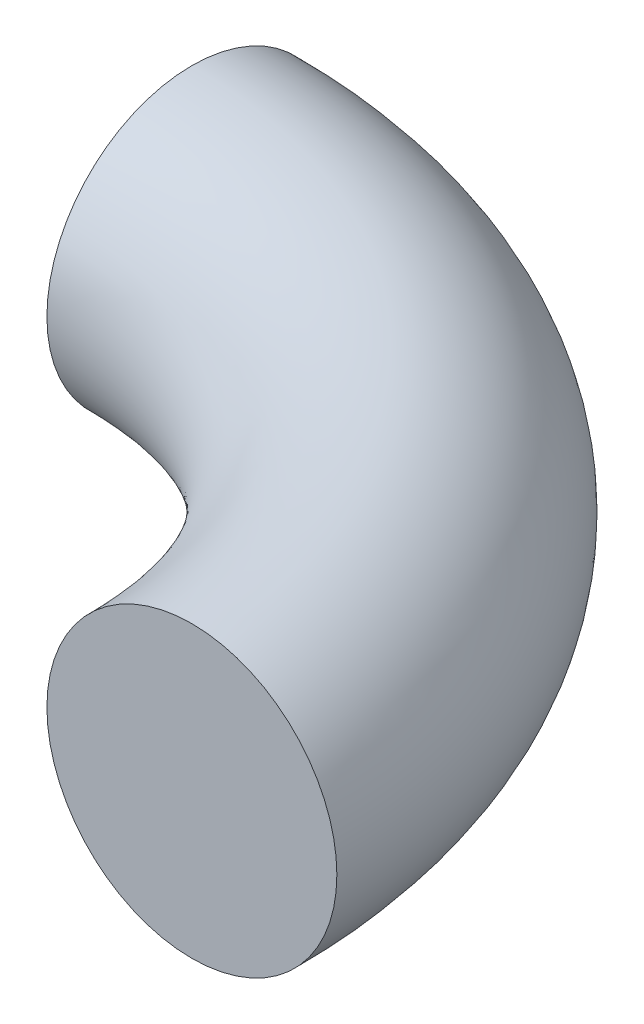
ISO-10303-21;
HEADER;
FILE_DESCRIPTION(('STEP AP214'),'2;1');
FILE_NAME('part.step','',(''),(''),'','','');
FILE_SCHEMA(('AUTOMOTIVE_DESIGN { 1 0 10303 214 1 1 1 1 }'));
ENDSEC;
DATA;
#1=APPLICATION_CONTEXT('core data for automotive mechanical design processes');
#2=APPLICATION_PROTOCOL_DEFINITION('international standard','automotive_design',2000,#1);
#3=PRODUCT_CONTEXT('',#1,'mechanical');
#4=PRODUCT('Part','Part','',(#3));
#5=PRODUCT_RELATED_PRODUCT_CATEGORY('part','',(#4));
#6=PRODUCT_DEFINITION_FORMATION('','',#4);
#7=PRODUCT_DEFINITION_CONTEXT('part definition',#1,'design');
#8=PRODUCT_DEFINITION('design','',#6,#7);
#9=PRODUCT_DEFINITION_SHAPE('','',#8);
#10=(LENGTH_UNIT() NAMED_UNIT(*) SI_UNIT(.MILLI.,.METRE.));
#11=(NAMED_UNIT(*) PLANE_ANGLE_UNIT() SI_UNIT($,.RADIAN.));
#12=(NAMED_UNIT(*) SI_UNIT($,.STERADIAN.) SOLID_ANGLE_UNIT());
#13=UNCERTAINTY_MEASURE_WITH_UNIT(LENGTH_MEASURE(1.E-05),#10,'distance_accuracy_value','');
#14=(GEOMETRIC_REPRESENTATION_CONTEXT(3) GLOBAL_UNCERTAINTY_ASSIGNED_CONTEXT((#13)) GLOBAL_UNIT_ASSIGNED_CONTEXT((#10,
#11,#12)) REPRESENTATION_CONTEXT('',''));
#15=CARTESIAN_POINT('',(0.,0.,0.));
#16=DIRECTION('',(0.,0.,1.));
#17=DIRECTION('',(1.,0.,0.));
#18=AXIS2_PLACEMENT_3D('',#15,#16,#17);
#19=CARTESIAN_POINT('',(0.,0.,0.));
#20=DIRECTION('',(0.,1.,0.));
#21=DIRECTION('',(0.,0.,1.));
#22=AXIS2_PLACEMENT_3D('',#19,#20,#21);
#23=TOROIDAL_SURFACE('',#22,100.,30.);
#24=CARTESIAN_POINT('',(100.,0.,0.));
#25=DIRECTION('',(0.,0.,1.));
#26=DIRECTION('',(1.,0.,0.));
#27=AXIS2_PLACEMENT_3D('',#24,#25,#26);
#28=CIRCLE('',#27,30.);
#29=CARTESIAN_POINT('',(130.,0.,0.));
#30=VERTEX_POINT('',#29);
#31=EDGE_CURVE('E50',#30,#30,#28,.T.);
#32=CARTESIAN_POINT('',(0.,0.,-100.));
#33=DIRECTION('',(-1.,0.,0.));
#34=DIRECTION('',(0.,0.,1.));
#35=AXIS2_PLACEMENT_3D('',#32,#33,#34);
#36=CIRCLE('',#35,30.);
#37=CARTESIAN_POINT('',(0.,0.,-130.));
#38=VERTEX_POINT('',#37);
#39=EDGE_CURVE('E10',#38,#38,#36,.T.);
#40=CARTESIAN_POINT('',(0.,0.,0.));
#41=DIRECTION('',(0.,1.,0.));
#42=DIRECTION('',(0.,0.,1.));
#43=AXIS2_PLACEMENT_3D('',#40,#41,#42);
#44=CIRCLE('',#43,130.);
#45=EDGE_CURVE('',#30,#38,#44,.T.);
#46=ORIENTED_EDGE('',*,*,#31,.F.);
#47=ORIENTED_EDGE('',*,*,#39,.F.);
#48=ORIENTED_EDGE('',*,*,#45,.T.);
#49=ORIENTED_EDGE('',*,*,#45,.F.);
#50=EDGE_LOOP('',(#46,#48,#47,#49));
#51=FACE_BOUND('',#50,.T.);
#52=ADVANCED_FACE('F43',(#51),#23,.T.);
#53=CARTESIAN_POINT('',(0.,465.698400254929,0.));
#54=DIRECTION('',(-1.,0.,0.));
#55=DIRECTION('',(0.,0.,1.));
#56=AXIS2_PLACEMENT_3D('',#53,#54,#55);
#57=PLANE('',#56);
#58=ORIENTED_EDGE('',*,*,#39,.T.);
#59=EDGE_LOOP('',(#58));
#60=FACE_BOUND('',#59,.T.);
#61=ADVANCED_FACE('F61',(#60),#57,.T.);
#62=CARTESIAN_POINT('',(0.,465.698400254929,0.));
#63=DIRECTION('',(0.,0.,1.));
#64=DIRECTION('',(1.,0.,0.));
#65=AXIS2_PLACEMENT_3D('',#62,#63,#64);
#66=PLANE('',#65);
#67=ORIENTED_EDGE('',*,*,#31,.T.);
#68=EDGE_LOOP('',(#67));
#69=FACE_BOUND('',#68,.T.);
#70=ADVANCED_FACE('F57',(#69),#66,.T.);
#71=CLOSED_SHELL('',(#52,#61,#70));
#72=MANIFOLD_SOLID_BREP('B2',#71);
#73=ADVANCED_BREP_SHAPE_REPRESENTATION('',(#18,#72),#14);
#74=SHAPE_DEFINITION_REPRESENTATION(#9,#73);
ENDSEC;
END-ISO-10303-21;
